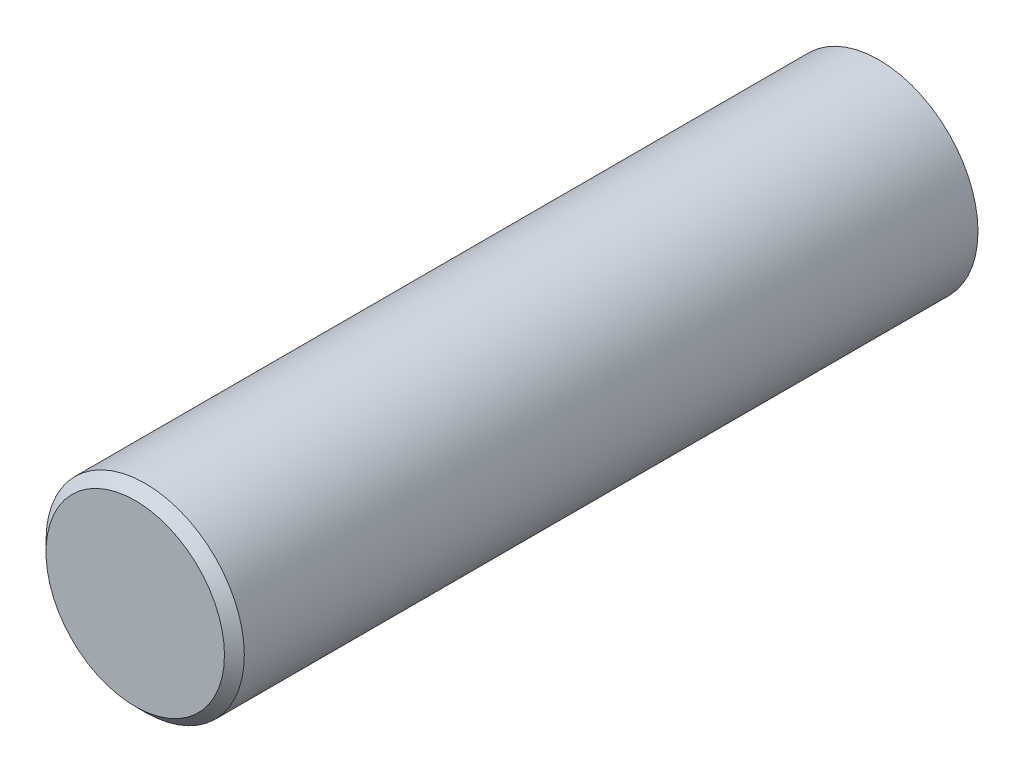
ISO-10303-21;
HEADER;
FILE_DESCRIPTION(('STEP AP214'),'2;1');
FILE_NAME('part.step','',(''),(''),'','','');
FILE_SCHEMA(('AUTOMOTIVE_DESIGN { 1 0 10303 214 1 1 1 1 }'));
ENDSEC;
DATA;
#1=APPLICATION_CONTEXT('core data for automotive mechanical design processes');
#2=APPLICATION_PROTOCOL_DEFINITION('international standard','automotive_design',2000,#1);
#3=PRODUCT_CONTEXT('',#1,'mechanical');
#4=PRODUCT('Part','Part','',(#3));
#5=PRODUCT_RELATED_PRODUCT_CATEGORY('part','',(#4));
#6=PRODUCT_DEFINITION_FORMATION('','',#4);
#7=PRODUCT_DEFINITION_CONTEXT('part definition',#1,'design');
#8=PRODUCT_DEFINITION('design','',#6,#7);
#9=PRODUCT_DEFINITION_SHAPE('','',#8);
#10=(LENGTH_UNIT() NAMED_UNIT(*) SI_UNIT(.MILLI.,.METRE.));
#11=(NAMED_UNIT(*) PLANE_ANGLE_UNIT() SI_UNIT($,.RADIAN.));
#12=(NAMED_UNIT(*) SI_UNIT($,.STERADIAN.) SOLID_ANGLE_UNIT());
#13=UNCERTAINTY_MEASURE_WITH_UNIT(LENGTH_MEASURE(1.E-05),#10,'distance_accuracy_value','');
#14=(GEOMETRIC_REPRESENTATION_CONTEXT(3) GLOBAL_UNCERTAINTY_ASSIGNED_CONTEXT((#13)) GLOBAL_UNIT_ASSIGNED_CONTEXT((#10,
#11,#12)) REPRESENTATION_CONTEXT('',''));
#15=CARTESIAN_POINT('',(0.,0.,0.));
#16=DIRECTION('',(0.,0.,1.));
#17=DIRECTION('',(1.,0.,0.));
#18=AXIS2_PLACEMENT_3D('',#15,#16,#17);
#19=CARTESIAN_POINT('',(0.,0.,60.));
#20=DIRECTION('',(0.,0.,-1.));
#21=DIRECTION('',(-1.,0.,0.));
#22=AXIS2_PLACEMENT_3D('',#19,#20,#21);
#23=CYLINDRICAL_SURFACE('',#22,8.);
#24=CARTESIAN_POINT('',(0.,0.,59.2));
#25=DIRECTION('',(0.,0.,1.));
#26=DIRECTION('',(1.,0.,0.));
#27=AXIS2_PLACEMENT_3D('',#24,#25,#26);
#28=CIRCLE('',#27,8.);
#29=CARTESIAN_POINT('',(8.,0.,59.2));
#30=VERTEX_POINT('',#29);
#31=EDGE_CURVE('E10',#30,#30,#28,.F.);
#32=ORIENTED_EDGE('',*,*,#31,.T.);
#33=EDGE_LOOP('',(#32));
#34=FACE_BOUND('',#33,.T.);
#35=CARTESIAN_POINT('',(0.,0.,0.));
#36=DIRECTION('',(0.,0.,1.));
#37=DIRECTION('',(1.,0.,0.));
#38=AXIS2_PLACEMENT_3D('',#35,#36,#37);
#39=CIRCLE('',#38,8.);
#40=CARTESIAN_POINT('',(8.,0.,0.));
#41=VERTEX_POINT('',#40);
#42=EDGE_CURVE('E37',#41,#41,#39,.T.);
#43=ORIENTED_EDGE('',*,*,#42,.T.);
#44=EDGE_LOOP('',(#43));
#45=FACE_BOUND('',#44,.T.);
#46=ADVANCED_FACE('F27',(#34,#45),#23,.T.);
#47=CARTESIAN_POINT('',(0.,0.,60.));
#48=DIRECTION('',(0.,0.,1.));
#49=DIRECTION('',(1.,0.,0.));
#50=AXIS2_PLACEMENT_3D('',#47,#48,#49);
#51=PLANE('',#50);
#52=CARTESIAN_POINT('',(0.,0.,60.));
#53=DIRECTION('',(0.,0.,1.));
#54=DIRECTION('',(1.,0.,0.));
#55=AXIS2_PLACEMENT_3D('',#52,#53,#54);
#56=CIRCLE('',#55,7.19999999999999);
#57=CARTESIAN_POINT('',(7.19999999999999,0.,60.));
#58=VERTEX_POINT('',#57);
#59=EDGE_CURVE('E33',#58,#58,#56,.T.);
#60=ORIENTED_EDGE('',*,*,#59,.T.);
#61=EDGE_LOOP('',(#60));
#62=FACE_BOUND('',#61,.T.);
#63=ADVANCED_FACE('F48',(#62),#51,.T.);
#64=CARTESIAN_POINT('',(0.,0.,0.));
#65=DIRECTION('',(0.,0.,1.));
#66=DIRECTION('',(1.,0.,0.));
#67=AXIS2_PLACEMENT_3D('',#64,#65,#66);
#68=PLANE('',#67);
#69=ORIENTED_EDGE('',*,*,#42,.F.);
#70=EDGE_LOOP('',(#69));
#71=FACE_BOUND('',#70,.T.);
#72=ADVANCED_FACE('F45',(#71),#68,.F.);
#73=CARTESIAN_POINT('',(0.,0.,60.));
#74=DIRECTION('',(0.,0.,-1.));
#75=DIRECTION('',(-1.,0.,0.));
#76=AXIS2_PLACEMENT_3D('',#73,#74,#75);
#77=CONICAL_SURFACE('',#76,7.19999999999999,0.785398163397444);
#78=ORIENTED_EDGE('',*,*,#31,.F.);
#79=EDGE_LOOP('',(#78));
#80=FACE_BOUND('',#79,.T.);
#81=ORIENTED_EDGE('',*,*,#59,.F.);
#82=EDGE_LOOP('',(#81));
#83=FACE_BOUND('',#82,.T.);
#84=ADVANCED_FACE('F47',(#80,#83),#77,.T.);
#85=CLOSED_SHELL('',(#46,#63,#72,#84));
#86=MANIFOLD_SOLID_BREP('B2',#85);
#87=ADVANCED_BREP_SHAPE_REPRESENTATION('',(#18,#86),#14);
#88=SHAPE_DEFINITION_REPRESENTATION(#9,#87);
ENDSEC;
END-ISO-10303-21;
